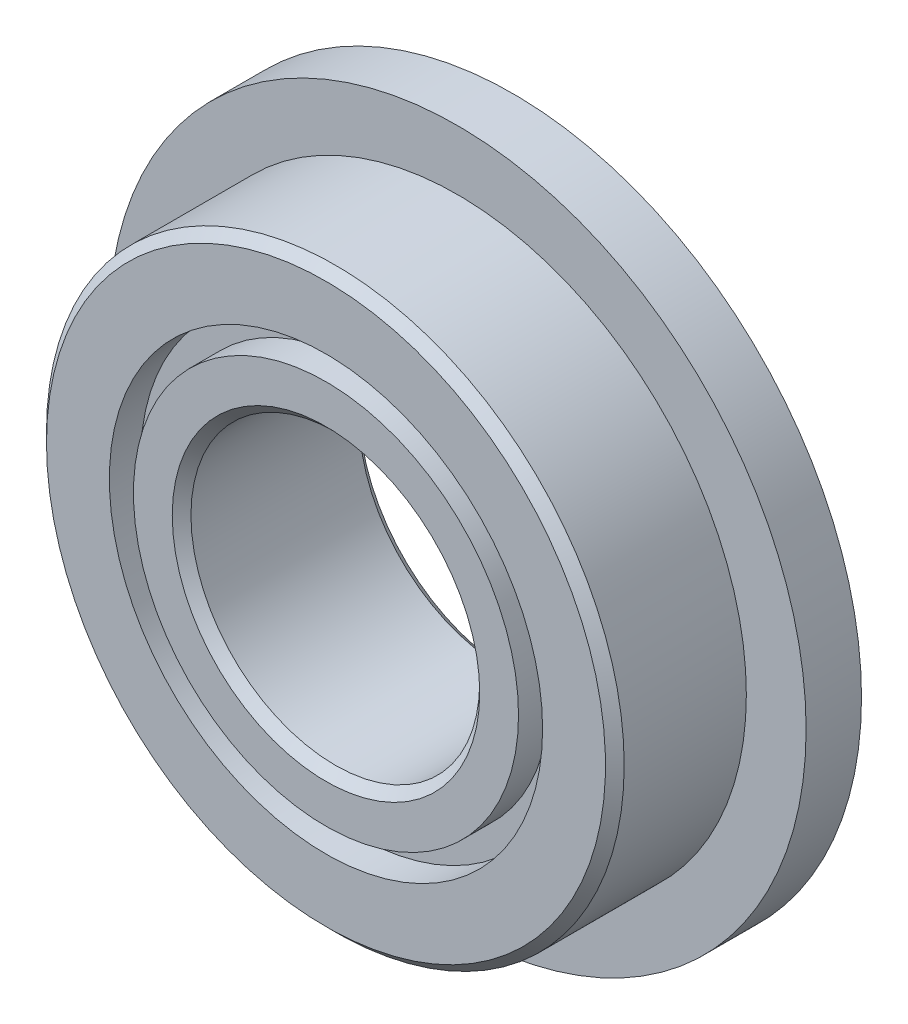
ISO-10303-21;
HEADER;
FILE_DESCRIPTION(('STEP AP214'),'2;1');
FILE_NAME('part.step','',(''),(''),'','','');
FILE_SCHEMA(('AUTOMOTIVE_DESIGN { 1 0 10303 214 1 1 1 1 }'));
ENDSEC;
DATA;
#1=APPLICATION_CONTEXT('core data for automotive mechanical design processes');
#2=APPLICATION_PROTOCOL_DEFINITION('international standard','automotive_design',2000,#1);
#3=PRODUCT_CONTEXT('',#1,'mechanical');
#4=PRODUCT('Part','Part','',(#3));
#5=PRODUCT_RELATED_PRODUCT_CATEGORY('part','',(#4));
#6=PRODUCT_DEFINITION_FORMATION('','',#4);
#7=PRODUCT_DEFINITION_CONTEXT('part definition',#1,'design');
#8=PRODUCT_DEFINITION('design','',#6,#7);
#9=PRODUCT_DEFINITION_SHAPE('','',#8);
#10=(LENGTH_UNIT() NAMED_UNIT(*) SI_UNIT(.MILLI.,.METRE.));
#11=(NAMED_UNIT(*) PLANE_ANGLE_UNIT() SI_UNIT($,.RADIAN.));
#12=(NAMED_UNIT(*) SI_UNIT($,.STERADIAN.) SOLID_ANGLE_UNIT());
#13=UNCERTAINTY_MEASURE_WITH_UNIT(LENGTH_MEASURE(1.E-05),#10,'distance_accuracy_value','');
#14=(GEOMETRIC_REPRESENTATION_CONTEXT(3) GLOBAL_UNCERTAINTY_ASSIGNED_CONTEXT((#13)) GLOBAL_UNIT_ASSIGNED_CONTEXT((#10,
#11,#12)) REPRESENTATION_CONTEXT('',''));
#15=CARTESIAN_POINT('',(0.,0.,0.));
#16=DIRECTION('',(0.,0.,1.));
#17=DIRECTION('',(1.,0.,0.));
#18=AXIS2_PLACEMENT_3D('',#15,#16,#17);
#19=CARTESIAN_POINT('',(0.,0.,1.93999999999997));
#20=DIRECTION('',(0.,0.,1.));
#21=DIRECTION('',(1.,0.,0.));
#22=AXIS2_PLACEMENT_3D('',#19,#20,#21);
#23=CYLINDRICAL_SURFACE('',#22,1.99858333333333);
#24=CARTESIAN_POINT('',(0.,0.,1.61666666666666));
#25=DIRECTION('',(0.,0.,1.));
#26=DIRECTION('',(1.,0.,0.));
#27=AXIS2_PLACEMENT_3D('',#24,#25,#26);
#28=CIRCLE('',#27,1.99858333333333);
#29=CARTESIAN_POINT('',(1.99858333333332,0.,1.61666666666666));
#30=VERTEX_POINT('',#29);
#31=EDGE_CURVE('E62',#30,#30,#28,.F.);
#32=ORIENTED_EDGE('',*,*,#31,.F.);
#33=EDGE_LOOP('',(#32));
#34=FACE_BOUND('',#33,.T.);
#35=CARTESIAN_POINT('',(0.,0.,1.93999999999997));
#36=DIRECTION('',(0.,0.,1.));
#37=DIRECTION('',(1.,0.,0.));
#38=AXIS2_PLACEMENT_3D('',#35,#36,#37);
#39=CIRCLE('',#38,1.99858333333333);
#40=CARTESIAN_POINT('',(1.99858333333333,0.,1.93999999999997));
#41=VERTEX_POINT('',#40);
#42=EDGE_CURVE('E17',#41,#41,#39,.T.);
#43=ORIENTED_EDGE('',*,*,#42,.F.);
#44=EDGE_LOOP('',(#43));
#45=FACE_BOUND('',#44,.T.);
#46=ADVANCED_FACE('F14',(#34,#45),#23,.T.);
#47=CARTESIAN_POINT('',(0.,0.,1.93999999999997));
#48=DIRECTION('',(0.,0.,1.));
#49=DIRECTION('',(1.,0.,0.));
#50=AXIS2_PLACEMENT_3D('',#47,#48,#49);
#51=PLANE('',#50);
#52=CARTESIAN_POINT('',(0.,0.,1.93999999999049));
#53=DIRECTION('',(0.,0.,1.));
#54=DIRECTION('',(1.,0.,0.));
#55=AXIS2_PLACEMENT_3D('',#52,#53,#54);
#56=CIRCLE('',#55,1.59574999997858);
#57=CARTESIAN_POINT('',(1.59574999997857,0.,1.93999999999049));
#58=VERTEX_POINT('',#57);
#59=EDGE_CURVE('E60',#58,#58,#56,.F.);
#60=ORIENTED_EDGE('',*,*,#59,.T.);
#61=EDGE_LOOP('',(#60));
#62=FACE_BOUND('',#61,.T.);
#63=ORIENTED_EDGE('',*,*,#42,.T.);
#64=EDGE_LOOP('',(#63));
#65=FACE_BOUND('',#64,.T.);
#66=ADVANCED_FACE('F69',(#62,#65),#51,.T.);
#67=CARTESIAN_POINT('',(0.,0.,1.61666666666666));
#68=DIRECTION('',(0.,0.,1.));
#69=DIRECTION('',(1.,0.,0.));
#70=AXIS2_PLACEMENT_3D('',#67,#68,#69);
#71=PLANE('',#70);
#72=ORIENTED_EDGE('',*,*,#31,.T.);
#73=EDGE_LOOP('',(#72));
#74=FACE_BOUND('',#73,.T.);
#75=CARTESIAN_POINT('',(0.,0.,1.61666666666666));
#76=DIRECTION('',(0.,0.,1.));
#77=DIRECTION('',(1.,0.,0.));
#78=AXIS2_PLACEMENT_3D('',#75,#76,#77);
#79=CIRCLE('',#78,2.2485);
#80=CARTESIAN_POINT('',(2.24849999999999,0.,1.61666666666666));
#81=VERTEX_POINT('',#80);
#82=EDGE_CURVE('E57',#81,#81,#79,.T.);
#83=ORIENTED_EDGE('',*,*,#82,.T.);
#84=EDGE_LOOP('',(#83));
#85=FACE_BOUND('',#84,.T.);
#86=ADVANCED_FACE('F77',(#74,#85),#71,.T.);
#87=CARTESIAN_POINT('',(0.,0.,1.93999999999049));
#88=DIRECTION('',(0.,0.,1.));
#89=DIRECTION('',(1.,0.,0.));
#90=AXIS2_PLACEMENT_3D('',#87,#88,#89);
#91=CONICAL_SURFACE('',#90,1.59574999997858,0.785398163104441);
#92=CARTESIAN_POINT('',(0.,0.,1.843));
#93=DIRECTION('',(0.,0.,1.));
#94=DIRECTION('',(1.,0.,0.));
#95=AXIS2_PLACEMENT_3D('',#92,#93,#94);
#96=CIRCLE('',#95,1.49875);
#97=CARTESIAN_POINT('',(1.49874999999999,0.,1.843));
#98=VERTEX_POINT('',#97);
#99=EDGE_CURVE('E29',#98,#98,#96,.F.);
#100=ORIENTED_EDGE('',*,*,#99,.T.);
#101=EDGE_LOOP('',(#100));
#102=FACE_BOUND('',#101,.T.);
#103=ORIENTED_EDGE('',*,*,#59,.F.);
#104=EDGE_LOOP('',(#103));
#105=FACE_BOUND('',#104,.T.);
#106=ADVANCED_FACE('F134',(#102,#105),#91,.F.);
#107=CARTESIAN_POINT('',(0.,0.,1.93999999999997));
#108=DIRECTION('',(0.,0.,1.));
#109=DIRECTION('',(1.,0.,0.));
#110=AXIS2_PLACEMENT_3D('',#107,#108,#109);
#111=CYLINDRICAL_SURFACE('',#110,2.2485);
#112=ORIENTED_EDGE('',*,*,#82,.F.);
#113=EDGE_LOOP('',(#112));
#114=FACE_BOUND('',#113,.T.);
#115=CARTESIAN_POINT('',(0.,0.,1.93999999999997));
#116=DIRECTION('',(0.,0.,1.));
#117=DIRECTION('',(1.,0.,0.));
#118=AXIS2_PLACEMENT_3D('',#115,#116,#117);
#119=CIRCLE('',#118,2.2485);
#120=CARTESIAN_POINT('',(2.2485,0.,1.93999999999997));
#121=VERTEX_POINT('',#120);
#122=EDGE_CURVE('E54',#121,#121,#119,.F.);
#123=ORIENTED_EDGE('',*,*,#122,.F.);
#124=EDGE_LOOP('',(#123));
#125=FACE_BOUND('',#124,.T.);
#126=ADVANCED_FACE('F130',(#114,#125),#111,.F.);
#127=CARTESIAN_POINT('',(0.,0.,1.93999999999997));
#128=DIRECTION('',(0.,0.,1.));
#129=DIRECTION('',(1.,0.,0.));
#130=AXIS2_PLACEMENT_3D('',#127,#128,#129);
#131=CYLINDRICAL_SURFACE('',#130,1.49875);
#132=ORIENTED_EDGE('',*,*,#99,.F.);
#133=EDGE_LOOP('',(#132));
#134=FACE_BOUND('',#133,.T.);
#135=CARTESIAN_POINT('',(0.,0.,0.0970000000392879));
#136=DIRECTION('',(0.,0.,-1.));
#137=DIRECTION('',(0.999999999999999,0.,0.));
#138=AXIS2_PLACEMENT_3D('',#135,#136,#137);
#139=CIRCLE('',#138,1.49874999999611);
#140=CARTESIAN_POINT('',(1.49874999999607,0.,0.0970000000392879));
#141=VERTEX_POINT('',#140);
#142=EDGE_CURVE('E53',#141,#141,#139,.T.);
#143=ORIENTED_EDGE('',*,*,#142,.T.);
#144=EDGE_LOOP('',(#143));
#145=FACE_BOUND('',#144,.T.);
#146=ADVANCED_FACE('F126',(#134,#145),#131,.F.);
#147=CARTESIAN_POINT('',(0.,0.,1.93999999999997));
#148=DIRECTION('',(0.,0.,1.));
#149=DIRECTION('',(1.,0.,0.));
#150=AXIS2_PLACEMENT_3D('',#147,#148,#149);
#151=PLANE('',#150);
#152=ORIENTED_EDGE('',*,*,#122,.T.);
#153=EDGE_LOOP('',(#152));
#154=FACE_BOUND('',#153,.T.);
#155=CARTESIAN_POINT('',(0.,0.,1.93999999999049));
#156=DIRECTION('',(0.,0.,-1.));
#157=DIRECTION('',(-1.,0.,0.));
#158=AXIS2_PLACEMENT_3D('',#155,#156,#157);
#159=CIRCLE('',#158,2.90124999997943);
#160=CARTESIAN_POINT('',(-2.90124999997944,0.,1.93999999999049));
#161=VERTEX_POINT('',#160);
#162=EDGE_CURVE('E50',#161,#161,#159,.T.);
#163=ORIENTED_EDGE('',*,*,#162,.F.);
#164=EDGE_LOOP('',(#163));
#165=FACE_BOUND('',#164,.T.);
#166=ADVANCED_FACE('F122',(#154,#165),#151,.T.);
#167=CARTESIAN_POINT('',(0.,0.,5.68156632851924E-11));
#168=DIRECTION('',(0.,0.,-1.));
#169=DIRECTION('',(-1.,0.,0.));
#170=AXIS2_PLACEMENT_3D('',#167,#168,#169);
#171=CONICAL_SURFACE('',#170,1.59574999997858,0.785398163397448);
#172=ORIENTED_EDGE('',*,*,#142,.F.);
#173=EDGE_LOOP('',(#172));
#174=FACE_BOUND('',#173,.T.);
#175=CARTESIAN_POINT('',(0.,0.,0.));
#176=DIRECTION('',(0.,0.,-1.));
#177=DIRECTION('',(-1.,0.,0.));
#178=AXIS2_PLACEMENT_3D('',#175,#176,#177);
#179=CIRCLE('',#178,1.59575000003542);
#180=CARTESIAN_POINT('',(-1.59575000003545,0.,0.));
#181=VERTEX_POINT('',#180);
#182=EDGE_CURVE('E47',#181,#181,#179,.T.);
#183=ORIENTED_EDGE('',*,*,#182,.T.);
#184=EDGE_LOOP('',(#183));
#185=FACE_BOUND('',#184,.T.);
#186=ADVANCED_FACE('F118',(#174,#185),#171,.F.);
#187=CARTESIAN_POINT('',(0.,0.,1.84299999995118));
#188=DIRECTION('',(0.,0.,-1.));
#189=DIRECTION('',(-1.,0.,0.));
#190=AXIS2_PLACEMENT_3D('',#187,#188,#189);
#191=CONICAL_SURFACE('',#190,2.99825000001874,0.785398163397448);
#192=CARTESIAN_POINT('',(0.,0.,1.843));
#193=DIRECTION('',(0.,0.,1.));
#194=DIRECTION('',(1.,0.,0.));
#195=AXIS2_PLACEMENT_3D('',#192,#193,#194);
#196=CIRCLE('',#195,2.99825);
#197=CARTESIAN_POINT('',(2.99824999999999,0.,1.843));
#198=VERTEX_POINT('',#197);
#199=EDGE_CURVE('E46',#198,#198,#196,.F.);
#200=ORIENTED_EDGE('',*,*,#199,.F.);
#201=EDGE_LOOP('',(#200));
#202=FACE_BOUND('',#201,.T.);
#203=ORIENTED_EDGE('',*,*,#162,.T.);
#204=EDGE_LOOP('',(#203));
#205=FACE_BOUND('',#204,.T.);
#206=ADVANCED_FACE('F114',(#202,#205),#191,.T.);
#207=CARTESIAN_POINT('',(0.,0.,0.));
#208=DIRECTION('',(0.,0.,1.));
#209=DIRECTION('',(1.,0.,0.));
#210=AXIS2_PLACEMENT_3D('',#207,#208,#209);
#211=PLANE('',#210);
#212=ORIENTED_EDGE('',*,*,#182,.F.);
#213=EDGE_LOOP('',(#212));
#214=FACE_BOUND('',#213,.T.);
#215=CARTESIAN_POINT('',(0.,0.,0.));
#216=DIRECTION('',(0.,0.,1.));
#217=DIRECTION('',(1.,0.,0.));
#218=AXIS2_PLACEMENT_3D('',#215,#216,#217);
#219=CIRCLE('',#218,1.99858333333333);
#220=CARTESIAN_POINT('',(1.9985833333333,0.,0.));
#221=VERTEX_POINT('',#220);
#222=EDGE_CURVE('E43',#221,#221,#219,.T.);
#223=ORIENTED_EDGE('',*,*,#222,.F.);
#224=EDGE_LOOP('',(#223));
#225=FACE_BOUND('',#224,.T.);
#226=ADVANCED_FACE('F110',(#214,#225),#211,.F.);
#227=CARTESIAN_POINT('',(0.,0.,0.));
#228=DIRECTION('',(0.,0.,1.));
#229=DIRECTION('',(1.,0.,0.));
#230=AXIS2_PLACEMENT_3D('',#227,#228,#229);
#231=CYLINDRICAL_SURFACE('',#230,2.99825);
#232=ORIENTED_EDGE('',*,*,#199,.T.);
#233=EDGE_LOOP('',(#232));
#234=FACE_BOUND('',#233,.T.);
#235=CARTESIAN_POINT('',(0.,0.,0.574999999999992));
#236=DIRECTION('',(0.,0.,1.));
#237=DIRECTION('',(1.,0.,0.));
#238=AXIS2_PLACEMENT_3D('',#235,#236,#237);
#239=CIRCLE('',#238,2.99825);
#240=CARTESIAN_POINT('',(2.99824999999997,0.,0.574999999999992));
#241=VERTEX_POINT('',#240);
#242=EDGE_CURVE('E40',#241,#241,#239,.F.);
#243=ORIENTED_EDGE('',*,*,#242,.F.);
#244=EDGE_LOOP('',(#243));
#245=FACE_BOUND('',#244,.T.);
#246=ADVANCED_FACE('F106',(#234,#245),#231,.T.);
#247=CARTESIAN_POINT('',(0.,0.,0.));
#248=DIRECTION('',(0.,0.,1.));
#249=DIRECTION('',(1.,0.,0.));
#250=AXIS2_PLACEMENT_3D('',#247,#248,#249);
#251=CYLINDRICAL_SURFACE('',#250,1.99858333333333);
#252=CARTESIAN_POINT('',(0.,0.,0.323333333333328));
#253=DIRECTION('',(0.,0.,1.));
#254=DIRECTION('',(1.,0.,0.));
#255=AXIS2_PLACEMENT_3D('',#252,#253,#254);
#256=CIRCLE('',#255,1.99858333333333);
#257=CARTESIAN_POINT('',(1.9985833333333,0.,0.323333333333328));
#258=VERTEX_POINT('',#257);
#259=EDGE_CURVE('E37',#258,#258,#256,.F.);
#260=ORIENTED_EDGE('',*,*,#259,.T.);
#261=EDGE_LOOP('',(#260));
#262=FACE_BOUND('',#261,.T.);
#263=ORIENTED_EDGE('',*,*,#222,.T.);
#264=EDGE_LOOP('',(#263));
#265=FACE_BOUND('',#264,.T.);
#266=ADVANCED_FACE('F102',(#262,#265),#251,.T.);
#267=CARTESIAN_POINT('',(0.,0.,0.574999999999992));
#268=DIRECTION('',(0.,0.,1.));
#269=DIRECTION('',(1.,0.,0.));
#270=AXIS2_PLACEMENT_3D('',#267,#268,#269);
#271=PLANE('',#270);
#272=ORIENTED_EDGE('',*,*,#242,.T.);
#273=EDGE_LOOP('',(#272));
#274=FACE_BOUND('',#273,.T.);
#275=CARTESIAN_POINT('',(0.,0.,0.574999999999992));
#276=DIRECTION('',(0.,0.,1.));
#277=DIRECTION('',(1.,0.,0.));
#278=AXIS2_PLACEMENT_3D('',#275,#276,#277);
#279=CIRCLE('',#278,3.61875);
#280=CARTESIAN_POINT('',(3.61874999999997,0.,0.574999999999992));
#281=VERTEX_POINT('',#280);
#282=EDGE_CURVE('E34',#281,#281,#279,.F.);
#283=ORIENTED_EDGE('',*,*,#282,.F.);
#284=EDGE_LOOP('',(#283));
#285=FACE_BOUND('',#284,.T.);
#286=ADVANCED_FACE('F98',(#274,#285),#271,.T.);
#287=CARTESIAN_POINT('',(0.,0.,0.323333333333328));
#288=DIRECTION('',(0.,0.,1.));
#289=DIRECTION('',(1.,0.,0.));
#290=AXIS2_PLACEMENT_3D('',#287,#288,#289);
#291=PLANE('',#290);
#292=ORIENTED_EDGE('',*,*,#259,.F.);
#293=EDGE_LOOP('',(#292));
#294=FACE_BOUND('',#293,.T.);
#295=CARTESIAN_POINT('',(0.,0.,0.323333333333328));
#296=DIRECTION('',(0.,0.,1.));
#297=DIRECTION('',(1.,0.,0.));
#298=AXIS2_PLACEMENT_3D('',#295,#296,#297);
#299=CIRCLE('',#298,2.2485);
#300=CARTESIAN_POINT('',(2.24849999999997,0.,0.323333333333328));
#301=VERTEX_POINT('',#300);
#302=EDGE_CURVE('E26',#301,#301,#299,.F.);
#303=ORIENTED_EDGE('',*,*,#302,.T.);
#304=EDGE_LOOP('',(#303));
#305=FACE_BOUND('',#304,.T.);
#306=ADVANCED_FACE('F94',(#294,#305),#291,.F.);
#307=CARTESIAN_POINT('',(0.,0.,0.));
#308=DIRECTION('',(0.,0.,1.));
#309=DIRECTION('',(1.,0.,0.));
#310=AXIS2_PLACEMENT_3D('',#307,#308,#309);
#311=CYLINDRICAL_SURFACE('',#310,3.61875);
#312=ORIENTED_EDGE('',*,*,#282,.T.);
#313=EDGE_LOOP('',(#312));
#314=FACE_BOUND('',#313,.T.);
#315=CARTESIAN_POINT('',(0.,0.,0.));
#316=DIRECTION('',(0.,0.,1.));
#317=DIRECTION('',(1.,0.,0.));
#318=AXIS2_PLACEMENT_3D('',#315,#316,#317);
#319=CIRCLE('',#318,3.61875);
#320=CARTESIAN_POINT('',(3.61874999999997,0.,0.));
#321=VERTEX_POINT('',#320);
#322=EDGE_CURVE('E21',#321,#321,#319,.T.);
#323=ORIENTED_EDGE('',*,*,#322,.T.);
#324=EDGE_LOOP('',(#323));
#325=FACE_BOUND('',#324,.T.);
#326=ADVANCED_FACE('F87',(#314,#325),#311,.T.);
#327=CARTESIAN_POINT('',(0.,0.,0.));
#328=DIRECTION('',(0.,0.,1.));
#329=DIRECTION('',(1.,0.,0.));
#330=AXIS2_PLACEMENT_3D('',#327,#328,#329);
#331=CYLINDRICAL_SURFACE('',#330,2.2485);
#332=ORIENTED_EDGE('',*,*,#302,.F.);
#333=EDGE_LOOP('',(#332));
#334=FACE_BOUND('',#333,.T.);
#335=CARTESIAN_POINT('',(0.,0.,0.));
#336=DIRECTION('',(0.,0.,1.));
#337=DIRECTION('',(1.,0.,0.));
#338=AXIS2_PLACEMENT_3D('',#335,#336,#337);
#339=CIRCLE('',#338,2.2485);
#340=CARTESIAN_POINT('',(2.24849999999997,0.,0.));
#341=VERTEX_POINT('',#340);
#342=EDGE_CURVE('E10',#341,#341,#339,.F.);
#343=ORIENTED_EDGE('',*,*,#342,.T.);
#344=EDGE_LOOP('',(#343));
#345=FACE_BOUND('',#344,.T.);
#346=ADVANCED_FACE('F81',(#334,#345),#331,.F.);
#347=CARTESIAN_POINT('',(0.,0.,0.));
#348=DIRECTION('',(0.,0.,1.));
#349=DIRECTION('',(1.,0.,0.));
#350=AXIS2_PLACEMENT_3D('',#347,#348,#349);
#351=PLANE('',#350);
#352=ORIENTED_EDGE('',*,*,#342,.F.);
#353=EDGE_LOOP('',(#352));
#354=FACE_BOUND('',#353,.T.);
#355=ORIENTED_EDGE('',*,*,#322,.F.);
#356=EDGE_LOOP('',(#355));
#357=FACE_BOUND('',#356,.T.);
#358=ADVANCED_FACE('F79',(#354,#357),#351,.F.);
#359=CLOSED_SHELL('',(#46,#66,#86,#106,#126,#146,#166,#186,#206,#226,#246,#266,#286,#306,#326,
#346,#358));
#360=MANIFOLD_SOLID_BREP('B1',#359);
#361=ADVANCED_BREP_SHAPE_REPRESENTATION('',(#18,#360),#14);
#362=SHAPE_DEFINITION_REPRESENTATION(#9,#361);
ENDSEC;
END-ISO-10303-21;
